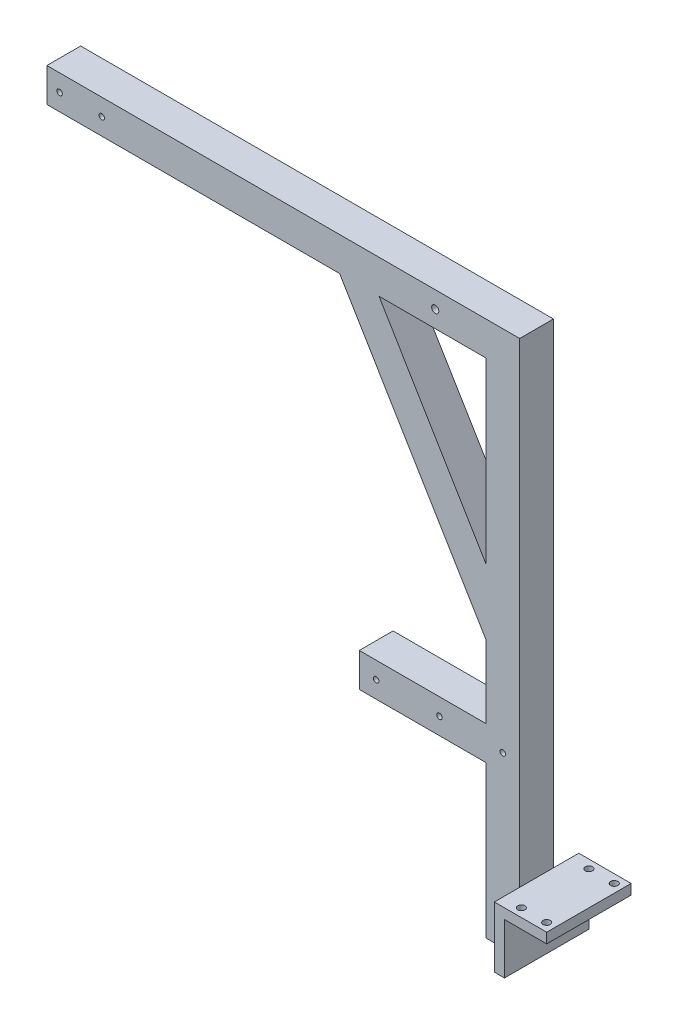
from build123d import *

# Parameters (mm, degrees)
EXTRUDE_1_DEPTH     = 100
SKETCH_2_OUTSIDE_W  = 802.898
SKETCH_2_OUTSIDE_H  = 280.898
SKETCH_2_OUTSIDE_R  = 4.25
CUT_EXTRUDE_1_DEPTH = 895.488121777
SKETCH_4_R          = 3.25
SKETCH_4_R_2        = 4.25
CUT_EXTRUDE_2_DEPTH = 100


with BuildPart() as part:
    # Sketch 1 → Extrude 1 (new body)
    with BuildSketch(Plane.XY):
        Polygon((560, 72), (560, 595), (560, 635), (0, 635), (0, 595), (346.676192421, 595), (520, 306.126987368), (520, 220), (370, 220), (370, 180), (520, 180), (520, 0), (572, 0), (572, 60), (622, 60), (622, 72), align=None)
        Polygon((393.323807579, 595), (520, 383.873012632), (520, 595), align=None, mode=Mode.SUBTRACT)
    extrude(amount=EXTRUDE_1_DEPTH)

    # Sketch 2 outside → Cut-Extrude 1 (cut, through all)
    # profile 1 of 5: a face of its own
    with BuildSketch(Plane(origin=(0, 635, 0), x_dir=(1, 0, 0), z_dir=(0, 1, 0))):
        with Locations((311, -50)):
            Rectangle(SKETCH_2_OUTSIDE_W, SKETCH_2_OUTSIDE_H)
        Polygon((0, -30), (560, -30), (560, 0), (622, 0), (622, -100), (560, -100), (560, -70), (0, -70), align=None, mode=Mode.SUBTRACT)
    # profile 2 of 5: a face of its own
    with BuildSketch(Plane(origin=(0, 635, 0), x_dir=(1, 0, 0), z_dir=(0, 1, 0))):
        with Locations(Location((582, -10, 0), (0, 0, 270))):
            Circle(SKETCH_2_OUTSIDE_R)
    # profile 3 of 5: a face of its own
    with BuildSketch(Plane(origin=(0, 635, 0), x_dir=(1, 0, 0), z_dir=(0, 1, 0))):
        with Locations(Location((612, -10, 0), (0, 0, 270))):
            Circle(SKETCH_2_OUTSIDE_R)
    # profile 4 of 5: a face of its own
    with BuildSketch(Plane(origin=(0, 635, 0), x_dir=(1, 0, 0), z_dir=(0, 1, 0))):
        with Locations(Location((612, -90, 0), (0, 0, 270))):
            Circle(SKETCH_2_OUTSIDE_R)
    # profile 5 of 5: a face of its own
    with BuildSketch(Plane(origin=(0, 635, 0), x_dir=(1, 0, 0), z_dir=(0, 1, 0))):
        with Locations(Location((582, -90, 0), (0, 0, 270))):
            Circle(SKETCH_2_OUTSIDE_R)
    extrude(amount=-CUT_EXTRUDE_1_DEPTH, mode=Mode.SUBTRACT)

    # Sketch 4 → Cut-Extrude 2 (cut)
    with BuildSketch(Plane.XY.offset(70)):
        with Locations((390, 200)):
            Circle(SKETCH_4_R)
        with Locations((465, 200)):
            Circle(SKETCH_4_R)
        with Locations((540, 200)):
            Circle(SKETCH_4_R)
        with Locations((460, 615)):
            Circle(SKETCH_4_R_2)
        with Locations((15, 615)):
            Circle(SKETCH_4_R)
        with Locations((65, 615)):
            Circle(SKETCH_4_R)
    extrude(amount=-CUT_EXTRUDE_2_DEPTH, mode=Mode.SUBTRACT)


solid = part.part
